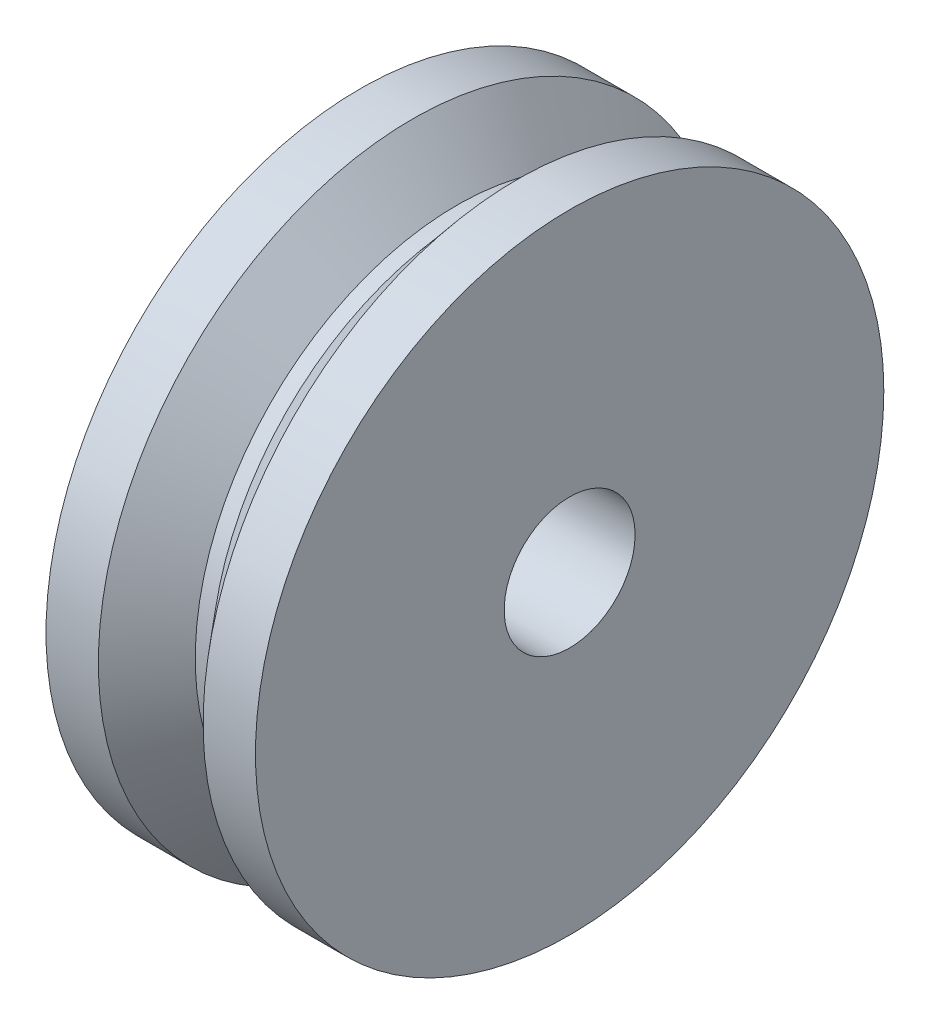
ISO-10303-21;
HEADER;
FILE_DESCRIPTION(('STEP AP214'),'2;1');
FILE_NAME('part.step','',(''),(''),'','','');
FILE_SCHEMA(('AUTOMOTIVE_DESIGN { 1 0 10303 214 1 1 1 1 }'));
ENDSEC;
DATA;
#1=APPLICATION_CONTEXT('core data for automotive mechanical design processes');
#2=APPLICATION_PROTOCOL_DEFINITION('international standard','automotive_design',2000,#1);
#3=PRODUCT_CONTEXT('',#1,'mechanical');
#4=PRODUCT('Part','Part','',(#3));
#5=PRODUCT_RELATED_PRODUCT_CATEGORY('part','',(#4));
#6=PRODUCT_DEFINITION_FORMATION('','',#4);
#7=PRODUCT_DEFINITION_CONTEXT('part definition',#1,'design');
#8=PRODUCT_DEFINITION('design','',#6,#7);
#9=PRODUCT_DEFINITION_SHAPE('','',#8);
#10=(LENGTH_UNIT() NAMED_UNIT(*) SI_UNIT(.MILLI.,.METRE.));
#11=(NAMED_UNIT(*) PLANE_ANGLE_UNIT() SI_UNIT($,.RADIAN.));
#12=(NAMED_UNIT(*) SI_UNIT($,.STERADIAN.) SOLID_ANGLE_UNIT());
#13=UNCERTAINTY_MEASURE_WITH_UNIT(LENGTH_MEASURE(1.E-05),#10,'distance_accuracy_value','');
#14=(GEOMETRIC_REPRESENTATION_CONTEXT(3) GLOBAL_UNCERTAINTY_ASSIGNED_CONTEXT((#13)) GLOBAL_UNIT_ASSIGNED_CONTEXT((#10,
#11,#12)) REPRESENTATION_CONTEXT('',''));
#15=CARTESIAN_POINT('',(0.,0.,0.));
#16=DIRECTION('',(0.,0.,1.));
#17=DIRECTION('',(1.,0.,0.));
#18=AXIS2_PLACEMENT_3D('',#15,#16,#17);
#19=CARTESIAN_POINT('',(-37.900000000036,12.4391913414,-1.0332103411));
#20=DIRECTION('',(1.,0.,0.));
#21=DIRECTION('',(0.,0.,-1.));
#22=AXIS2_PLACEMENT_3D('',#19,#20,#21);
#23=CONICAL_SURFACE('',#22,6.00000000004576,0.866302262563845);
#24=CARTESIAN_POINT('',(-37.9,12.4391913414,-1.0332103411));
#25=DIRECTION('',(1.,0.,0.));
#26=DIRECTION('',(0.,0.,-1.));
#27=AXIS2_PLACEMENT_3D('',#24,#25,#26);
#28=CIRCLE('',#27,6.);
#29=CARTESIAN_POINT('',(-37.9,12.4391913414,-7.0332103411));
#30=VERTEX_POINT('',#29);
#31=EDGE_CURVE('E44',#30,#30,#28,.T.);
#32=ORIENTED_EDGE('',*,*,#31,.F.);
#33=EDGE_LOOP('',(#32));
#34=FACE_BOUND('',#33,.T.);
#35=CARTESIAN_POINT('',(-38.75,12.4391913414,-1.0332103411));
#36=DIRECTION('',(1.,0.,0.));
#37=DIRECTION('',(0.,0.,-1.));
#38=AXIS2_PLACEMENT_3D('',#35,#36,#37);
#39=CIRCLE('',#38,5.);
#40=CARTESIAN_POINT('',(-38.75,12.4391913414,-6.0332103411));
#41=VERTEX_POINT('',#40);
#42=EDGE_CURVE('E30',#41,#41,#39,.F.);
#43=ORIENTED_EDGE('',*,*,#42,.F.);
#44=EDGE_LOOP('',(#43));
#45=FACE_BOUND('',#44,.T.);
#46=ADVANCED_FACE('F15',(#34,#45),#23,.T.);
#47=CARTESIAN_POINT('',(-38.9,12.4391913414,-1.0332103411));
#48=DIRECTION('',(1.,0.,0.));
#49=DIRECTION('',(0.,0.,-1.));
#50=AXIS2_PLACEMENT_3D('',#47,#48,#49);
#51=CYLINDRICAL_SURFACE('',#50,5.);
#52=ORIENTED_EDGE('',*,*,#42,.T.);
#53=EDGE_LOOP('',(#52));
#54=FACE_BOUND('',#53,.T.);
#55=CARTESIAN_POINT('',(-39.0499999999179,12.4391913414,-1.0332103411));
#56=DIRECTION('',(-1.,0.,0.));
#57=DIRECTION('',(0.,0.877582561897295,0.479425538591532));
#58=AXIS2_PLACEMENT_3D('',#55,#56,#57);
#59=CIRCLE('',#58,4.99999999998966);
#60=CARTESIAN_POINT('',(-39.0499999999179,16.8271041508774,1.36391735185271));
#61=VERTEX_POINT('',#60);
#62=EDGE_CURVE('E41',#61,#61,#59,.T.);
#63=ORIENTED_EDGE('',*,*,#62,.F.);
#64=EDGE_LOOP('',(#63));
#65=FACE_BOUND('',#64,.T.);
#66=ADVANCED_FACE('F51',(#54,#65),#51,.T.);
#67=CARTESIAN_POINT('',(-38.9,12.4391913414,-1.0332103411));
#68=DIRECTION('',(1.,0.,0.));
#69=DIRECTION('',(0.,0.,-1.));
#70=AXIS2_PLACEMENT_3D('',#67,#68,#69);
#71=CYLINDRICAL_SURFACE('',#70,6.);
#72=CARTESIAN_POINT('',(-36.9,12.4391913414,-1.0332103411));
#73=DIRECTION('',(1.,0.,0.));
#74=DIRECTION('',(0.,0.,-1.));
#75=AXIS2_PLACEMENT_3D('',#72,#73,#74);
#76=CIRCLE('',#75,6.);
#77=CARTESIAN_POINT('',(-36.9,12.4391913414,-7.0332103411));
#78=VERTEX_POINT('',#77);
#79=EDGE_CURVE('E18',#78,#78,#76,.T.);
#80=ORIENTED_EDGE('',*,*,#79,.F.);
#81=EDGE_LOOP('',(#80));
#82=FACE_BOUND('',#81,.T.);
#83=ORIENTED_EDGE('',*,*,#31,.T.);
#84=EDGE_LOOP('',(#83));
#85=FACE_BOUND('',#84,.T.);
#86=ADVANCED_FACE('F60',(#82,#85),#71,.T.);
#87=CARTESIAN_POINT('',(-39.8999999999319,12.4391913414,-1.0332103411));
#88=DIRECTION('',(-1.,0.,0.));
#89=DIRECTION('',(0.,0.,1.));
#90=AXIS2_PLACEMENT_3D('',#87,#88,#89);
#91=CONICAL_SURFACE('',#90,6.00000000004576,0.866302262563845);
#92=ORIENTED_EDGE('',*,*,#62,.T.);
#93=EDGE_LOOP('',(#92));
#94=FACE_BOUND('',#93,.T.);
#95=CARTESIAN_POINT('',(-39.9,12.4391913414,-1.0332103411));
#96=DIRECTION('',(1.,0.,0.));
#97=DIRECTION('',(0.,0.,-1.));
#98=AXIS2_PLACEMENT_3D('',#95,#96,#97);
#99=CIRCLE('',#98,6.);
#100=CARTESIAN_POINT('',(-39.9,12.4391913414,-7.0332103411));
#101=VERTEX_POINT('',#100);
#102=EDGE_CURVE('E33',#101,#101,#99,.F.);
#103=ORIENTED_EDGE('',*,*,#102,.F.);
#104=EDGE_LOOP('',(#103));
#105=FACE_BOUND('',#104,.T.);
#106=ADVANCED_FACE('F79',(#94,#105),#91,.T.);
#107=CARTESIAN_POINT('',(-36.9,12.4391913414,-1.0332103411));
#108=DIRECTION('',(1.,0.,0.));
#109=DIRECTION('',(0.,0.,-1.));
#110=AXIS2_PLACEMENT_3D('',#107,#108,#109);
#111=PLANE('',#110);
#112=CARTESIAN_POINT('',(-36.9,12.4391913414,-1.0332103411));
#113=DIRECTION('',(1.,0.,0.));
#114=DIRECTION('',(0.,0.,-1.));
#115=AXIS2_PLACEMENT_3D('',#112,#113,#114);
#116=CIRCLE('',#115,1.25);
#117=CARTESIAN_POINT('',(-36.9,12.4391913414,-2.2832103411));
#118=VERTEX_POINT('',#117);
#119=EDGE_CURVE('E27',#118,#118,#116,.F.);
#120=ORIENTED_EDGE('',*,*,#119,.T.);
#121=EDGE_LOOP('',(#120));
#122=FACE_BOUND('',#121,.T.);
#123=ORIENTED_EDGE('',*,*,#79,.T.);
#124=EDGE_LOOP('',(#123));
#125=FACE_BOUND('',#124,.T.);
#126=ADVANCED_FACE('F75',(#122,#125),#111,.T.);
#127=CARTESIAN_POINT('',(-38.9,12.4391913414,-1.0332103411));
#128=DIRECTION('',(1.,0.,0.));
#129=DIRECTION('',(0.,0.,-1.));
#130=AXIS2_PLACEMENT_3D('',#127,#128,#129);
#131=CYLINDRICAL_SURFACE('',#130,6.);
#132=CARTESIAN_POINT('',(-40.9,12.4391913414,-1.0332103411));
#133=DIRECTION('',(1.,0.,0.));
#134=DIRECTION('',(0.,0.,-1.));
#135=AXIS2_PLACEMENT_3D('',#132,#133,#134);
#136=CIRCLE('',#135,6.);
#137=CARTESIAN_POINT('',(-40.9,12.4391913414,-7.0332103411));
#138=VERTEX_POINT('',#137);
#139=EDGE_CURVE('E22',#138,#138,#136,.T.);
#140=ORIENTED_EDGE('',*,*,#139,.T.);
#141=EDGE_LOOP('',(#140));
#142=FACE_BOUND('',#141,.T.);
#143=ORIENTED_EDGE('',*,*,#102,.T.);
#144=EDGE_LOOP('',(#143));
#145=FACE_BOUND('',#144,.T.);
#146=ADVANCED_FACE('F69',(#142,#145),#131,.T.);
#147=CARTESIAN_POINT('',(-38.9,12.4391913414,-1.0332103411));
#148=DIRECTION('',(1.,0.,0.));
#149=DIRECTION('',(0.,0.,-1.));
#150=AXIS2_PLACEMENT_3D('',#147,#148,#149);
#151=CYLINDRICAL_SURFACE('',#150,1.25);
#152=CARTESIAN_POINT('',(-40.9,12.4391913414,-1.0332103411));
#153=DIRECTION('',(1.,0.,0.));
#154=DIRECTION('',(0.,0.,-1.));
#155=AXIS2_PLACEMENT_3D('',#152,#153,#154);
#156=CIRCLE('',#155,1.25);
#157=CARTESIAN_POINT('',(-40.9,12.4391913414,-2.2832103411));
#158=VERTEX_POINT('',#157);
#159=EDGE_CURVE('E10',#158,#158,#156,.F.);
#160=ORIENTED_EDGE('',*,*,#159,.T.);
#161=EDGE_LOOP('',(#160));
#162=FACE_BOUND('',#161,.T.);
#163=ORIENTED_EDGE('',*,*,#119,.F.);
#164=EDGE_LOOP('',(#163));
#165=FACE_BOUND('',#164,.T.);
#166=ADVANCED_FACE('F63',(#162,#165),#151,.F.);
#167=CARTESIAN_POINT('',(-40.9,12.4391913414,-1.0332103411));
#168=DIRECTION('',(1.,0.,0.));
#169=DIRECTION('',(0.,0.,-1.));
#170=AXIS2_PLACEMENT_3D('',#167,#168,#169);
#171=PLANE('',#170);
#172=ORIENTED_EDGE('',*,*,#159,.F.);
#173=EDGE_LOOP('',(#172));
#174=FACE_BOUND('',#173,.T.);
#175=ORIENTED_EDGE('',*,*,#139,.F.);
#176=EDGE_LOOP('',(#175));
#177=FACE_BOUND('',#176,.T.);
#178=ADVANCED_FACE('F61',(#174,#177),#171,.F.);
#179=CLOSED_SHELL('',(#46,#66,#86,#106,#126,#146,#166,#178));
#180=MANIFOLD_SOLID_BREP('B1',#179);
#181=ADVANCED_BREP_SHAPE_REPRESENTATION('',(#18,#180),#14);
#182=SHAPE_DEFINITION_REPRESENTATION(#9,#181);
ENDSEC;
END-ISO-10303-21;
